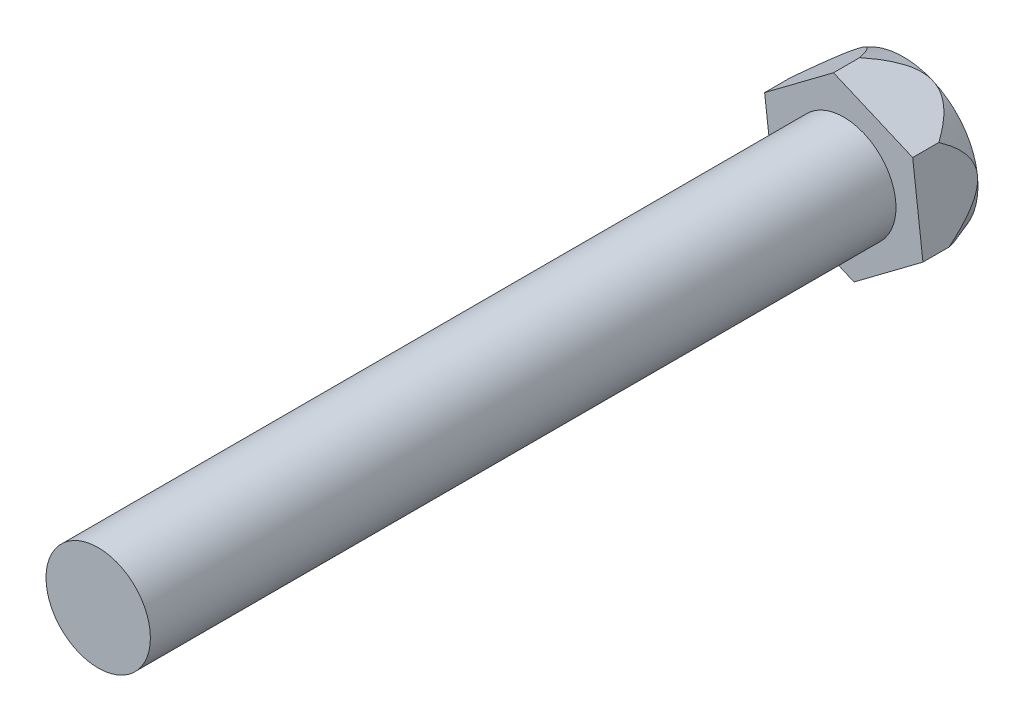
ISO-10303-21;
HEADER;
FILE_DESCRIPTION(('STEP AP214'),'2;1');
FILE_NAME('part.step','',(''),(''),'','','');
FILE_SCHEMA(('AUTOMOTIVE_DESIGN { 1 0 10303 214 1 1 1 1 }'));
ENDSEC;
DATA;
#1=APPLICATION_CONTEXT('core data for automotive mechanical design processes');
#2=APPLICATION_PROTOCOL_DEFINITION('international standard','automotive_design',2000,#1);
#3=PRODUCT_CONTEXT('',#1,'mechanical');
#4=PRODUCT('Part','Part','',(#3));
#5=PRODUCT_RELATED_PRODUCT_CATEGORY('part','',(#4));
#6=PRODUCT_DEFINITION_FORMATION('','',#4);
#7=PRODUCT_DEFINITION_CONTEXT('part definition',#1,'design');
#8=PRODUCT_DEFINITION('design','',#6,#7);
#9=PRODUCT_DEFINITION_SHAPE('','',#8);
#10=(LENGTH_UNIT() NAMED_UNIT(*) SI_UNIT(.MILLI.,.METRE.));
#11=(NAMED_UNIT(*) PLANE_ANGLE_UNIT() SI_UNIT($,.RADIAN.));
#12=(NAMED_UNIT(*) SI_UNIT($,.STERADIAN.) SOLID_ANGLE_UNIT());
#13=UNCERTAINTY_MEASURE_WITH_UNIT(LENGTH_MEASURE(1.E-05),#10,'distance_accuracy_value','');
#14=(GEOMETRIC_REPRESENTATION_CONTEXT(3) GLOBAL_UNCERTAINTY_ASSIGNED_CONTEXT((#13)) GLOBAL_UNIT_ASSIGNED_CONTEXT((#10,
#11,#12)) REPRESENTATION_CONTEXT('',''));
#15=CARTESIAN_POINT('',(0.,0.,0.));
#16=DIRECTION('',(0.,0.,1.));
#17=DIRECTION('',(1.,0.,0.));
#18=AXIS2_PLACEMENT_3D('',#15,#16,#17);
#19=CARTESIAN_POINT('',(-2.65433075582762,1.13483988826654,-2.));
#20=DIRECTION('',(0.599739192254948,-0.800195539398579,0.));
#21=DIRECTION('',(0.800195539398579,0.599739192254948,0.));
#22=AXIS2_PLACEMENT_3D('',#19,#20,#21);
#23=PLANE('',#22);
#24=CARTESIAN_POINT('',(-2.65453075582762,1.13468999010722,-0.876429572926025));
#25=CARTESIAN_POINT('',(-2.61397960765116,1.16508270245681,-0.949895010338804));
#26=CARTESIAN_POINT('',(-2.57240922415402,1.1962393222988,-1.02255898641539));
#27=CARTESIAN_POINT('',(-2.48624521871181,1.26081845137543,-1.16579680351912));
#28=CARTESIAN_POINT('',(-2.44163289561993,1.29425497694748,-1.23635298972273));
#29=CARTESIAN_POINT('',(-2.34691478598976,1.36524532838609,-1.37685450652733));
#30=CARTESIAN_POINT('',(-2.29665431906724,1.40291508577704,-1.44663919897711));
#31=CARTESIAN_POINT('',(-2.19130617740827,1.48187254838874,-1.58002441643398));
#32=CARTESIAN_POINT('',(-2.13623381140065,1.52314877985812,-1.64364328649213));
#33=CARTESIAN_POINT('',(-2.03330510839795,1.60029289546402,-1.74742819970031));
#34=CARTESIAN_POINT('',(-1.98676618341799,1.63517339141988,-1.78960194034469));
#35=CARTESIAN_POINT('',(-1.88962660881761,1.70797860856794,-1.86510191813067));
#36=CARTESIAN_POINT('',(-1.83906018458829,1.74587767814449,-1.89849410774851));
#37=CARTESIAN_POINT('',(-1.7477470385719,1.81431604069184,-1.94555658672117));
#38=CARTESIAN_POINT('',(-1.70796922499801,1.84412914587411,-1.96211055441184));
#39=CARTESIAN_POINT('',(-1.62674464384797,1.90500622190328,-1.98676873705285));
#40=CARTESIAN_POINT('',(-1.58529922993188,1.93606917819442,-1.99487966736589));
#41=CARTESIAN_POINT('',(-1.50171314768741,1.99871617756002,-2.00158308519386));
#42=CARTESIAN_POINT('',(-1.45957020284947,2.03030192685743,-2.00013295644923));
#43=CARTESIAN_POINT('',(-1.37617242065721,2.09280779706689,-1.98782827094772));
#44=CARTESIAN_POINT('',(-1.33491843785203,2.12372727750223,-1.97696504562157));
#45=CARTESIAN_POINT('',(-1.24372484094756,2.19207603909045,-1.94327703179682));
#46=CARTESIAN_POINT('',(-1.19436522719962,2.22907061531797,-1.91805257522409));
#47=CARTESIAN_POINT('',(-1.09940091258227,2.30024549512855,-1.85828360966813));
#48=CARTESIAN_POINT('',(-1.05380691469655,2.33441777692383,-1.82371365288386));
#49=CARTESIAN_POINT('',(-0.968881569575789,2.39806854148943,-1.75047456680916));
#50=CARTESIAN_POINT('',(-0.929338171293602,2.42770595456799,-1.71218048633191));
#51=CARTESIAN_POINT('',(-0.852957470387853,2.48495258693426,-1.63154685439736));
#52=CARTESIAN_POINT('',(-0.816122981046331,2.51255969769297,-1.58920319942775));
#53=CARTESIAN_POINT('',(-0.74465070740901,2.56612750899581,-1.50147563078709));
#54=CARTESIAN_POINT('',(-0.710020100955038,2.59208282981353,-1.4560826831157));
#55=CARTESIAN_POINT('',(-0.642688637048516,2.64254714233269,-1.36310591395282));
#56=CARTESIAN_POINT('',(-0.60998835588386,2.66705570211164,-1.31552144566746));
#57=CARTESIAN_POINT('',(-0.536524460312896,2.72211621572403,-1.20400605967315));
#58=CARTESIAN_POINT('',(-0.496326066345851,2.7522445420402,-1.1394974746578));
#59=CARTESIAN_POINT('',(-0.418538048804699,2.8105459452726,-1.00901477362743));
#60=CARTESIAN_POINT('',(-0.380927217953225,2.83873491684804,-0.943060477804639));
#61=CARTESIAN_POINT('',(-0.344165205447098,2.86628770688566,-0.876429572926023));
#62=B_SPLINE_CURVE_WITH_KNOTS('',3,(#24,#25,#26,#27,#28,#29,#30,#31,#32,#33,#34,#35,#36,#37,#38,
#39,#40,#41,#42,#43,#44,#45,#46,#47,#48,#49,#50,#51,#52,#53,#54,#55,#56,#57,#58,#59,#60,#61),
.UNSPECIFIED.,.F.,.F.,(4,2,2,2,2,2,2,2,2,2,2,2,2,2,2,2,2,2,4),(0.,0.267829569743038,
0.537487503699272,0.818897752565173,1.09944322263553,1.31448609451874,1.52786455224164,
1.68444599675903,1.84090280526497,1.99805745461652,2.15535698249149,2.35415678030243,
2.55350345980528,2.7407772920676,2.92824294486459,3.11629082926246,3.304394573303,
3.54959331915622,3.79245578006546),.UNSPECIFIED.);
#63=CARTESIAN_POINT('',(-2.65433075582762,1.13483988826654,-0.876792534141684));
#64=VERTEX_POINT('',#63);
#65=CARTESIAN_POINT('',(-1.49934798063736,2.00048884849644,-2.));
#66=VERTEX_POINT('',#65);
#67=EDGE_CURVE('E239',#64,#66,#62,.T.);
#68=ORIENTED_EDGE('',*,*,#67,.F.);
#69=DIRECTION('',(0.,0.,1.));
#70=VECTOR('',#69,1.);
#71=CARTESIAN_POINT('',(-2.65433075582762,1.13483988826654,-2.));
#72=LINE('',#71,#70);
#73=CARTESIAN_POINT('',(-2.65433075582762,1.13483988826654,0.));
#74=VERTEX_POINT('',#73);
#75=EDGE_CURVE('E222',#64,#74,#72,.T.);
#76=ORIENTED_EDGE('',*,*,#75,.T.);
#77=DIRECTION('',(0.800195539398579,0.599739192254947,0.));
#78=VECTOR('',#77,1.);
#79=CARTESIAN_POINT('',(-2.65433075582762,1.13483988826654,0.));
#80=LINE('',#79,#78);
#81=CARTESIAN_POINT('',(-0.344365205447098,2.86613780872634,0.));
#82=VERTEX_POINT('',#81);
#83=EDGE_CURVE('E237',#74,#82,#80,.T.);
#84=ORIENTED_EDGE('',*,*,#83,.T.);
#85=DIRECTION('',(0.,0.,1.));
#86=VECTOR('',#85,1.);
#87=CARTESIAN_POINT('',(-0.344365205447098,2.86613780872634,-2.));
#88=LINE('',#87,#86);
#89=CARTESIAN_POINT('',(-0.344365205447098,2.86613780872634,-0.876792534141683));
#90=VERTEX_POINT('',#89);
#91=EDGE_CURVE('E211',#90,#82,#88,.T.);
#92=ORIENTED_EDGE('',*,*,#91,.F.);
#93=EDGE_CURVE('E107',#66,#90,#62,.T.);
#94=ORIENTED_EDGE('',*,*,#93,.F.);
#95=EDGE_LOOP('',(#68,#76,#84,#92,#94));
#96=FACE_BOUND('',#95,.T.);
#97=ADVANCED_FACE('F31',(#96),#23,.F.);
#98=CARTESIAN_POINT('',(-0.344365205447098,2.86613780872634,-2.));
#99=DIRECTION('',(-0.393120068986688,-0.919487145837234,0.));
#100=DIRECTION('',(0.919487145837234,-0.393120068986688,0.));
#101=AXIS2_PLACEMENT_3D('',#98,#99,#100);
#102=PLANE('',#101);
#103=CARTESIAN_POINT('',(-0.344565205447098,2.86622331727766,-0.876476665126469));
#104=CARTESIAN_POINT('',(-0.297968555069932,2.84630125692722,-0.949941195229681));
#105=CARTESIAN_POINT('',(-0.250200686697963,2.82587845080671,-1.02260423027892));
#106=CARTESIAN_POINT('',(-0.151190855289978,2.78354751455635,-1.16584008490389));
#107=CARTESIAN_POINT('',(-0.0999273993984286,2.76163019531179,-1.23639524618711));
#108=CARTESIAN_POINT('',(0.00891229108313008,2.71509657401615,-1.37689467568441));
#109=CARTESIAN_POINT('',(0.066666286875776,2.69040427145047,-1.4466782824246));
#110=CARTESIAN_POINT('',(0.187721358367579,2.63864805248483,-1.58006082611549));
#111=CARTESIAN_POINT('',(0.251004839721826,2.61159165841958,-1.6436781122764));
#112=CARTESIAN_POINT('',(0.369278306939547,2.56102469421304,-1.74745794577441));
#113=CARTESIAN_POINT('',(0.422754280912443,2.53816142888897,-1.78962856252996));
#114=CARTESIAN_POINT('',(0.534373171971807,2.49043958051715,-1.8651221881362));
#115=CARTESIAN_POINT('',(0.592476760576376,2.46559781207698,-1.89851115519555));
#116=CARTESIAN_POINT('',(0.697401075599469,2.42073818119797,-1.94556857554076));
#117=CARTESIAN_POINT('',(0.743108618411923,2.40119625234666,-1.96212053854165));
#118=CARTESIAN_POINT('',(0.836441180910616,2.36129259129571,-1.98677468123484));
#119=CARTESIAN_POINT('',(0.884064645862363,2.34093152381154,-1.9948835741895));
#120=CARTESIAN_POINT('',(0.980110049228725,2.29986800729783,-2.00158313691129));
#121=CARTESIAN_POINT('',(1.02853460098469,2.27916444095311,-2.00013120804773));
#122=CARTESIAN_POINT('',(1.1243629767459,2.23819371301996,-1.98782344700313));
#123=CARTESIAN_POINT('',(1.17176581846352,2.21792697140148,-1.97695894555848));
#124=CARTESIAN_POINT('',(1.27655467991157,2.17312525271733,-1.94326771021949));
#125=CARTESIAN_POINT('',(1.33327403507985,2.14887530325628,-1.91804080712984));
#126=CARTESIAN_POINT('',(1.44239774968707,2.10222024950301,-1.85826685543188));
#127=CARTESIAN_POINT('',(1.49478980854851,2.0798204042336,-1.82369435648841));
#128=CARTESIAN_POINT('',(1.59237886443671,2.03809691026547,-1.75044929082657));
#129=CARTESIAN_POINT('',(1.63781942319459,2.01866912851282,-1.71215159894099));
#130=CARTESIAN_POINT('',(1.72559076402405,1.98114312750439,-1.63151059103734));
#131=CARTESIAN_POINT('',(1.76791831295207,1.96304629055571,-1.58916317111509));
#132=CARTESIAN_POINT('',(1.85004901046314,1.9279319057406,-1.50142802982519));
#133=CARTESIAN_POINT('',(1.88984391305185,1.91091788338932,-1.45603127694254));
#134=CARTESIAN_POINT('',(1.9672161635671,1.87783793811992,-1.36304687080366));
#135=CARTESIAN_POINT('',(2.00479284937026,1.86177229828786,-1.31545857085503));
#136=CARTESIAN_POINT('',(2.08919479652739,1.82568685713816,-1.20395701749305));
#137=CARTESIAN_POINT('',(2.13537167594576,1.80594426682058,-1.13946709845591));
#138=CARTESIAN_POINT('',(2.22472961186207,1.76773992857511,-1.00902258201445));
#139=CARTESIAN_POINT('',(2.26793501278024,1.74926777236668,-0.94308778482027));
#140=CARTESIAN_POINT('',(2.31016555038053,1.73121241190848,-0.876476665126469));
#141=B_SPLINE_CURVE_WITH_KNOTS('',3,(#103,#104,#105,#106,#107,#108,#109,#110,#111,#112,#113,
#114,#115,#116,#117,#118,#119,#120,#121,#122,#123,#124,#125,#126,#127,#128,#129,#130,#131,#132,
#133,#134,#135,#136,#137,#138,#139,#140),.UNSPECIFIED.,.F.,.F.,(4,2,2,2,2,2,2,2,2,2,2,2,2,2,2,2,
2,2,4),(0.,0.26782773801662,0.537484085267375,0.818893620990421,1.09943825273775,
1.31447326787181,1.5278438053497,1.6844224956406,1.84087659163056,1.99802824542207,
2.15532479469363,2.35413126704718,2.55348468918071,2.74077056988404,2.92824829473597,
3.11630811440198,3.30442378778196,3.54954994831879,3.79234144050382),.UNSPECIFIED.);
#142=CARTESIAN_POINT('',(0.982800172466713,2.29871786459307,-2.));
#143=VERTEX_POINT('',#142);
#144=EDGE_CURVE('E103',#90,#143,#141,.T.);
#145=ORIENTED_EDGE('',*,*,#144,.F.);
#146=ORIENTED_EDGE('',*,*,#91,.T.);
#147=DIRECTION('',(0.919487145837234,-0.393120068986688,0.));
#148=VECTOR('',#147,1.);
#149=CARTESIAN_POINT('',(-0.344365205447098,2.86613780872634,0.));
#150=LINE('',#149,#148);
#151=CARTESIAN_POINT('',(2.30996555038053,1.7312979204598,0.));
#152=VERTEX_POINT('',#151);
#153=EDGE_CURVE('E236',#82,#152,#150,.T.);
#154=ORIENTED_EDGE('',*,*,#153,.T.);
#155=DIRECTION('',(0.,0.,1.));
#156=VECTOR('',#155,1.);
#157=CARTESIAN_POINT('',(2.30996555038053,1.7312979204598,-2.));
#158=LINE('',#157,#156);
#159=CARTESIAN_POINT('',(2.30996555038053,1.7312979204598,-0.876792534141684));
#160=VERTEX_POINT('',#159);
#161=EDGE_CURVE('E126',#160,#152,#158,.T.);
#162=ORIENTED_EDGE('',*,*,#161,.F.);
#163=EDGE_CURVE('E111',#143,#160,#141,.T.);
#164=ORIENTED_EDGE('',*,*,#163,.F.);
#165=EDGE_LOOP('',(#145,#146,#154,#162,#164));
#166=FACE_BOUND('',#165,.T.);
#167=ADVANCED_FACE('F124',(#166),#102,.F.);
#168=CARTESIAN_POINT('',(2.30996555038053,1.7312979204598,-2.));
#169=DIRECTION('',(-0.992859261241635,-0.119291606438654,0.));
#170=DIRECTION('',(0.119291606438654,-0.992859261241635,0.));
#171=AXIS2_PLACEMENT_3D('',#168,#169,#170);
#172=PLANE('',#171);
#173=CARTESIAN_POINT('',(2.30994152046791,1.7314979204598,-0.876500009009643));
#174=CARTESIAN_POINT('',(2.31598684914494,1.68118289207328,-0.949964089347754));
#175=CARTESIAN_POINT('',(2.32218413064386,1.62960316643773,-1.02262665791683));
#176=CARTESIAN_POINT('',(2.33502942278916,1.5226923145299,-1.16586153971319));
#177=CARTESIAN_POINT('',(2.34168022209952,1.46733797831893,-1.23641619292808));
#178=CARTESIAN_POINT('',(2.35580084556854,1.34981259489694,-1.3769145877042));
#179=CARTESIAN_POINT('',(2.36329373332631,1.28744959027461,-1.44669765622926));
#180=CARTESIAN_POINT('',(2.37899918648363,1.15673373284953,-1.58007887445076));
#181=CARTESIAN_POINT('',(2.3872094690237,1.08839988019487,-1.64369537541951));
#182=CARTESIAN_POINT('',(2.40255394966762,0.960688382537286,-1.74747269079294));
#183=CARTESIAN_POINT('',(2.40949171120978,0.902945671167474,-1.78964175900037));
#184=CARTESIAN_POINT('',(2.42397269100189,0.78242105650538,-1.86513223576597));
#185=CARTESIAN_POINT('',(2.43151080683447,0.719681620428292,-1.89851960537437));
#186=CARTESIAN_POINT('',(2.44512328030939,0.606385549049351,-1.94557451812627));
#187=CARTESIAN_POINT('',(2.45105322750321,0.557030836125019,-1.96212548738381));
#188=CARTESIAN_POINT('',(2.46316187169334,0.456251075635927,-1.98677762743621));
#189=CARTESIAN_POINT('',(2.46934036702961,0.404827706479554,-1.99488551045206));
#190=CARTESIAN_POINT('',(2.48180092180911,0.301119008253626,-2.00158316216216));
#191=CARTESIAN_POINT('',(2.48808332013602,0.248830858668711,-2.00013034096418));
#192=CARTESIAN_POINT('',(2.50051567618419,0.145356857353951,-1.9878210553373));
#193=CARTESIAN_POINT('',(2.50666550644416,0.094172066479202,-1.97695592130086));
#194=CARTESIAN_POINT('',(2.52026052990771,-0.0189787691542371,-1.94326308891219));
#195=CARTESIAN_POINT('',(2.5276192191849,-0.0802248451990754,-1.91803497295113));
#196=CARTESIAN_POINT('',(2.54177676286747,-0.198057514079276,-1.85825854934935));
#197=CARTESIAN_POINT('',(2.54857402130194,-0.254630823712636,-1.82368479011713));
#198=CARTESIAN_POINT('',(2.56123514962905,-0.360008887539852,-1.75043675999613));
#199=CARTESIAN_POINT('',(2.56713061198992,-0.40907658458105,-1.71213727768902));
#200=CARTESIAN_POINT('',(2.57851806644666,-0.503853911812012,-1.63149261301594));
#201=CARTESIAN_POINT('',(2.58400963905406,-0.54956005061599,-1.58914332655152));
#202=CARTESIAN_POINT('',(2.59466526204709,-0.638246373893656,-1.50140443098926));
#203=CARTESIAN_POINT('',(2.59982824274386,-0.681217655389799,-1.45600579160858));
#204=CARTESIAN_POINT('',(2.60986649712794,-0.764765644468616,-1.36301759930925));
#205=CARTESIAN_POINT('',(2.61474168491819,-0.80534163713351,-1.31542739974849));
#206=CARTESIAN_POINT('',(2.62569086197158,-0.896471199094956,-1.20393270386));
#207=CARTESIAN_POINT('',(2.63168080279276,-0.946325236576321,-1.13945203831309));
#208=CARTESIAN_POINT('',(2.64327213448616,-1.04279942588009,-1.00902645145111));
#209=CARTESIAN_POINT('',(2.64887668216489,-1.08944585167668,-0.943101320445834));
#210=CARTESIAN_POINT('',(2.65435478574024,-1.13503988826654,-0.876500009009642));
#211=B_SPLINE_CURVE_WITH_KNOTS('',3,(#173,#174,#175,#176,#177,#178,#179,#180,#181,#182,#183,
#184,#185,#186,#187,#188,#189,#190,#191,#192,#193,#194,#195,#196,#197,#198,#199,#200,#201,#202,
#203,#204,#205,#206,#207,#208,#209,#210),.UNSPECIFIED.,.F.,.F.,(4,2,2,2,2,2,2,2,2,2,2,2,2,2,2,2,
2,2,4),(0.,0.267826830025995,0.537482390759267,0.818891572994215,1.0994357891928,
1.31446690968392,1.5278335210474,1.68441084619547,1.84086359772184,1.99801376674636,
2.15530883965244,2.35411862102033,2.55347538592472,2.74076723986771,2.92825094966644,
3.11631668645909,3.30443827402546,3.54952845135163,3.79228476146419),.UNSPECIFIED.);
#212=CARTESIAN_POINT('',(2.48214815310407,0.298229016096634,-2.));
#213=VERTEX_POINT('',#212);
#214=EDGE_CURVE('E116',#160,#213,#211,.T.);
#215=ORIENTED_EDGE('',*,*,#214,.F.);
#216=ORIENTED_EDGE('',*,*,#161,.T.);
#217=DIRECTION('',(0.119291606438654,-0.992859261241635,0.));
#218=VECTOR('',#217,1.);
#219=CARTESIAN_POINT('',(2.30996555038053,1.7312979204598,0.));
#220=LINE('',#219,#218);
#221=CARTESIAN_POINT('',(2.65433075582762,-1.13483988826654,0.));
#222=VERTEX_POINT('',#221);
#223=EDGE_CURVE('E233',#152,#222,#220,.T.);
#224=ORIENTED_EDGE('',*,*,#223,.T.);
#225=DIRECTION('',(0.,0.,1.));
#226=VECTOR('',#225,1.);
#227=CARTESIAN_POINT('',(2.65433075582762,-1.13483988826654,-2.));
#228=LINE('',#227,#226);
#229=CARTESIAN_POINT('',(2.65433075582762,-1.13483988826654,-0.876792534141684));
#230=VERTEX_POINT('',#229);
#231=EDGE_CURVE('E216',#230,#222,#228,.T.);
#232=ORIENTED_EDGE('',*,*,#231,.F.);
#233=EDGE_CURVE('E127',#213,#230,#211,.T.);
#234=ORIENTED_EDGE('',*,*,#233,.F.);
#235=EDGE_LOOP('',(#215,#216,#224,#232,#234));
#236=FACE_BOUND('',#235,.T.);
#237=ADVANCED_FACE('F181',(#236),#172,.F.);
#238=CARTESIAN_POINT('',(2.65433075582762,-1.13483988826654,-2.));
#239=DIRECTION('',(-0.599739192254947,0.800195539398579,0.));
#240=DIRECTION('',(-0.800195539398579,-0.599739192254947,0.));
#241=AXIS2_PLACEMENT_3D('',#238,#239,#240);
#242=PLANE('',#241);
#243=CARTESIAN_POINT('',(2.65453075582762,-1.13468999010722,-0.876429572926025));
#244=CARTESIAN_POINT('',(2.61397960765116,-1.16508270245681,-0.949895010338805));
#245=CARTESIAN_POINT('',(2.57240922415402,-1.1962393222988,-1.02255898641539));
#246=CARTESIAN_POINT('',(2.48624521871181,-1.26081845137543,-1.16579680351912));
#247=CARTESIAN_POINT('',(2.44163289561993,-1.29425497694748,-1.23635298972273));
#248=CARTESIAN_POINT('',(2.34691478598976,-1.36524532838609,-1.37685450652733));
#249=CARTESIAN_POINT('',(2.29665431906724,-1.40291508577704,-1.44663919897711));
#250=CARTESIAN_POINT('',(2.19130617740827,-1.48187254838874,-1.58002441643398));
#251=CARTESIAN_POINT('',(2.13623381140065,-1.52314877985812,-1.64364328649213));
#252=CARTESIAN_POINT('',(2.03330510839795,-1.60029289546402,-1.74742819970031));
#253=CARTESIAN_POINT('',(1.986766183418,-1.63517339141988,-1.78960194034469));
#254=CARTESIAN_POINT('',(1.88962660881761,-1.70797860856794,-1.86510191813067));
#255=CARTESIAN_POINT('',(1.83906018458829,-1.74587767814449,-1.89849410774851));
#256=CARTESIAN_POINT('',(1.7477470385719,-1.81431604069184,-1.94555658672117));
#257=CARTESIAN_POINT('',(1.70796922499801,-1.84412914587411,-1.96211055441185));
#258=CARTESIAN_POINT('',(1.62674464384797,-1.90500622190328,-1.98676873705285));
#259=CARTESIAN_POINT('',(1.58529922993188,-1.93606917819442,-1.99487966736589));
#260=CARTESIAN_POINT('',(1.50171314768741,-1.99871617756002,-2.00158308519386));
#261=CARTESIAN_POINT('',(1.45957020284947,-2.03030192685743,-2.00013295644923));
#262=CARTESIAN_POINT('',(1.37617242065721,-2.09280779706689,-1.98782827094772));
#263=CARTESIAN_POINT('',(1.33491843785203,-2.12372727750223,-1.97696504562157));
#264=CARTESIAN_POINT('',(1.24372484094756,-2.19207603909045,-1.94327703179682));
#265=CARTESIAN_POINT('',(1.19436522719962,-2.22907061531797,-1.91805257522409));
#266=CARTESIAN_POINT('',(1.09940091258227,-2.30024549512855,-1.85828360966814));
#267=CARTESIAN_POINT('',(1.05380691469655,-2.33441777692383,-1.82371365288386));
#268=CARTESIAN_POINT('',(0.968881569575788,-2.39806854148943,-1.75047456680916));
#269=CARTESIAN_POINT('',(0.929338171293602,-2.42770595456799,-1.71218048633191));
#270=CARTESIAN_POINT('',(0.852957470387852,-2.48495258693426,-1.63154685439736));
#271=CARTESIAN_POINT('',(0.81612298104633,-2.51255969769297,-1.58920319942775));
#272=CARTESIAN_POINT('',(0.744650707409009,-2.56612750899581,-1.50147563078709));
#273=CARTESIAN_POINT('',(0.710020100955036,-2.59208282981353,-1.4560826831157));
#274=CARTESIAN_POINT('',(0.642688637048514,-2.64254714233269,-1.36310591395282));
#275=CARTESIAN_POINT('',(0.609988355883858,-2.66705570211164,-1.31552144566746));
#276=CARTESIAN_POINT('',(0.536524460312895,-2.72211621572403,-1.20400605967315));
#277=CARTESIAN_POINT('',(0.49632606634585,-2.7522445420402,-1.1394974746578));
#278=CARTESIAN_POINT('',(0.418538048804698,-2.8105459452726,-1.00901477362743));
#279=CARTESIAN_POINT('',(0.380927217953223,-2.83873491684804,-0.94306047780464));
#280=CARTESIAN_POINT('',(0.344165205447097,-2.86628770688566,-0.876429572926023));
#281=B_SPLINE_CURVE_WITH_KNOTS('',3,(#243,#244,#245,#246,#247,#248,#249,#250,#251,#252,#253,
#254,#255,#256,#257,#258,#259,#260,#261,#262,#263,#264,#265,#266,#267,#268,#269,#270,#271,#272,
#273,#274,#275,#276,#277,#278,#279,#280),.UNSPECIFIED.,.F.,.F.,(4,2,2,2,2,2,2,2,2,2,2,2,2,2,2,2,
2,2,4),(0.,0.267829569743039,0.537487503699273,0.818897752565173,1.09944322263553,
1.31448609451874,1.52786455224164,1.68444599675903,1.84090280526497,1.99805745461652,
2.15535698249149,2.35415678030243,2.55350345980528,2.7407772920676,2.92824294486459,
3.11629082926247,3.304394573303,3.54959331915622,3.79245578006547),.UNSPECIFIED.);
#282=CARTESIAN_POINT('',(1.49934798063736,-2.00048884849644,-2.));
#283=VERTEX_POINT('',#282);
#284=EDGE_CURVE('E175',#230,#283,#281,.T.);
#285=ORIENTED_EDGE('',*,*,#284,.F.);
#286=ORIENTED_EDGE('',*,*,#231,.T.);
#287=DIRECTION('',(-0.800195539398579,-0.599739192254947,0.));
#288=VECTOR('',#287,1.);
#289=CARTESIAN_POINT('',(2.65433075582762,-1.13483988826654,0.));
#290=LINE('',#289,#288);
#291=CARTESIAN_POINT('',(0.344365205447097,-2.86613780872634,0.));
#292=VERTEX_POINT('',#291);
#293=EDGE_CURVE('E230',#222,#292,#290,.T.);
#294=ORIENTED_EDGE('',*,*,#293,.T.);
#295=DIRECTION('',(0.,0.,1.));
#296=VECTOR('',#295,1.);
#297=CARTESIAN_POINT('',(0.344365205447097,-2.86613780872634,-2.));
#298=LINE('',#297,#296);
#299=CARTESIAN_POINT('',(0.344365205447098,-2.86613780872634,-0.876792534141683));
#300=VERTEX_POINT('',#299);
#301=EDGE_CURVE('E218',#300,#292,#298,.T.);
#302=ORIENTED_EDGE('',*,*,#301,.F.);
#303=EDGE_CURVE('E170',#283,#300,#281,.T.);
#304=ORIENTED_EDGE('',*,*,#303,.F.);
#305=EDGE_LOOP('',(#285,#286,#294,#302,#304));
#306=FACE_BOUND('',#305,.T.);
#307=ADVANCED_FACE('F177',(#306),#242,.F.);
#308=CARTESIAN_POINT('',(0.344365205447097,-2.86613780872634,-2.));
#309=DIRECTION('',(0.393120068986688,0.919487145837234,0.));
#310=DIRECTION('',(-0.919487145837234,0.393120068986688,0.));
#311=AXIS2_PLACEMENT_3D('',#308,#309,#310);
#312=PLANE('',#311);
#313=CARTESIAN_POINT('',(0.344565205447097,-2.86622331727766,-0.876476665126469));
#314=CARTESIAN_POINT('',(0.297968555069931,-2.84630125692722,-0.949941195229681));
#315=CARTESIAN_POINT('',(0.250200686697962,-2.82587845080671,-1.02260423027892));
#316=CARTESIAN_POINT('',(0.151190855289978,-2.78354751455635,-1.16584008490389));
#317=CARTESIAN_POINT('',(0.0999273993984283,-2.76163019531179,-1.23639524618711));
#318=CARTESIAN_POINT('',(-0.00891229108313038,-2.71509657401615,-1.37689467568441));
#319=CARTESIAN_POINT('',(-0.0666662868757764,-2.69040427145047,-1.4466782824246));
#320=CARTESIAN_POINT('',(-0.187721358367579,-2.63864805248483,-1.58006082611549));
#321=CARTESIAN_POINT('',(-0.251004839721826,-2.61159165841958,-1.6436781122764));
#322=CARTESIAN_POINT('',(-0.369278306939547,-2.56102469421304,-1.74745794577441));
#323=CARTESIAN_POINT('',(-0.422754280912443,-2.53816142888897,-1.78962856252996));
#324=CARTESIAN_POINT('',(-0.534373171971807,-2.49043958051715,-1.8651221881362));
#325=CARTESIAN_POINT('',(-0.592476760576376,-2.46559781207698,-1.89851115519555));
#326=CARTESIAN_POINT('',(-0.697401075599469,-2.42073818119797,-1.94556857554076));
#327=CARTESIAN_POINT('',(-0.743108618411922,-2.40119625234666,-1.96212053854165));
#328=CARTESIAN_POINT('',(-0.836441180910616,-2.36129259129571,-1.98677468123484));
#329=CARTESIAN_POINT('',(-0.884064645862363,-2.34093152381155,-1.9948835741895));
#330=CARTESIAN_POINT('',(-0.980110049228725,-2.29986800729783,-2.00158313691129));
#331=CARTESIAN_POINT('',(-1.02853460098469,-2.27916444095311,-2.00013120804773));
#332=CARTESIAN_POINT('',(-1.1243629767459,-2.23819371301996,-1.98782344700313));
#333=CARTESIAN_POINT('',(-1.17176581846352,-2.21792697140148,-1.97695894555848));
#334=CARTESIAN_POINT('',(-1.27655467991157,-2.17312525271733,-1.9432677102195));
#335=CARTESIAN_POINT('',(-1.33327403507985,-2.14887530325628,-1.91804080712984));
#336=CARTESIAN_POINT('',(-1.44239774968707,-2.10222024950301,-1.85826685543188));
#337=CARTESIAN_POINT('',(-1.49478980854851,-2.0798204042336,-1.82369435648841));
#338=CARTESIAN_POINT('',(-1.59237886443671,-2.03809691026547,-1.75044929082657));
#339=CARTESIAN_POINT('',(-1.63781942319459,-2.01866912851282,-1.71215159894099));
#340=CARTESIAN_POINT('',(-1.72559076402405,-1.98114312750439,-1.63151059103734));
#341=CARTESIAN_POINT('',(-1.76791831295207,-1.96304629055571,-1.58916317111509));
#342=CARTESIAN_POINT('',(-1.85004901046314,-1.9279319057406,-1.50142802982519));
#343=CARTESIAN_POINT('',(-1.88984391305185,-1.91091788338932,-1.45603127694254));
#344=CARTESIAN_POINT('',(-1.9672161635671,-1.87783793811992,-1.36304687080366));
#345=CARTESIAN_POINT('',(-2.00479284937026,-1.86177229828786,-1.31545857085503));
#346=CARTESIAN_POINT('',(-2.08919479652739,-1.82568685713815,-1.20395701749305));
#347=CARTESIAN_POINT('',(-2.13537167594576,-1.80594426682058,-1.13946709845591));
#348=CARTESIAN_POINT('',(-2.22472961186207,-1.76773992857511,-1.00902258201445));
#349=CARTESIAN_POINT('',(-2.26793501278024,-1.74926777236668,-0.943087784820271));
#350=CARTESIAN_POINT('',(-2.31016555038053,-1.73121241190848,-0.876476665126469));
#351=B_SPLINE_CURVE_WITH_KNOTS('',3,(#313,#314,#315,#316,#317,#318,#319,#320,#321,#322,#323,
#324,#325,#326,#327,#328,#329,#330,#331,#332,#333,#334,#335,#336,#337,#338,#339,#340,#341,#342,
#343,#344,#345,#346,#347,#348,#349,#350),.UNSPECIFIED.,.F.,.F.,(4,2,2,2,2,2,2,2,2,2,2,2,2,2,2,2,
2,2,4),(0.,0.26782773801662,0.537484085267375,0.818893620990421,1.09943825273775,
1.31447326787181,1.5278438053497,1.6844224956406,1.84087659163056,1.99802824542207,
2.15532479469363,2.35413126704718,2.55348468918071,2.74077056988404,2.92824829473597,
3.11630811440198,3.30442378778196,3.54954994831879,3.79234144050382),.UNSPECIFIED.);
#352=CARTESIAN_POINT('',(-0.982800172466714,-2.29871786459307,-2.));
#353=VERTEX_POINT('',#352);
#354=EDGE_CURVE('E176',#300,#353,#351,.T.);
#355=ORIENTED_EDGE('',*,*,#354,.F.);
#356=ORIENTED_EDGE('',*,*,#301,.T.);
#357=DIRECTION('',(-0.919487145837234,0.393120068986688,0.));
#358=VECTOR('',#357,1.);
#359=CARTESIAN_POINT('',(0.344365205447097,-2.86613780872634,0.));
#360=LINE('',#359,#358);
#361=CARTESIAN_POINT('',(-2.30996555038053,-1.7312979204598,0.));
#362=VERTEX_POINT('',#361);
#363=EDGE_CURVE('E227',#292,#362,#360,.T.);
#364=ORIENTED_EDGE('',*,*,#363,.T.);
#365=DIRECTION('',(0.,0.,1.));
#366=VECTOR('',#365,1.);
#367=CARTESIAN_POINT('',(-2.30996555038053,-1.7312979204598,-2.));
#368=LINE('',#367,#366);
#369=CARTESIAN_POINT('',(-2.30996555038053,-1.7312979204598,-0.876792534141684));
#370=VERTEX_POINT('',#369);
#371=EDGE_CURVE('E220',#370,#362,#368,.T.);
#372=ORIENTED_EDGE('',*,*,#371,.F.);
#373=EDGE_CURVE('E164',#353,#370,#351,.T.);
#374=ORIENTED_EDGE('',*,*,#373,.F.);
#375=EDGE_LOOP('',(#355,#356,#364,#372,#374));
#376=FACE_BOUND('',#375,.T.);
#377=ADVANCED_FACE('F180',(#376),#312,.F.);
#378=CARTESIAN_POINT('',(-2.30996555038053,-1.7312979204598,-2.));
#379=DIRECTION('',(0.992859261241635,0.119291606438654,0.));
#380=DIRECTION('',(-0.119291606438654,0.992859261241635,0.));
#381=AXIS2_PLACEMENT_3D('',#378,#379,#380);
#382=PLANE('',#381);
#383=CARTESIAN_POINT('',(-2.30994152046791,-1.7314979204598,-0.876500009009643));
#384=CARTESIAN_POINT('',(-2.31598684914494,-1.68118289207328,-0.949964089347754));
#385=CARTESIAN_POINT('',(-2.32218413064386,-1.62960316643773,-1.02262665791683));
#386=CARTESIAN_POINT('',(-2.33502942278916,-1.5226923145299,-1.16586153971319));
#387=CARTESIAN_POINT('',(-2.34168022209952,-1.46733797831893,-1.23641619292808));
#388=CARTESIAN_POINT('',(-2.35580084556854,-1.34981259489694,-1.3769145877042));
#389=CARTESIAN_POINT('',(-2.36329373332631,-1.28744959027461,-1.44669765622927));
#390=CARTESIAN_POINT('',(-2.37899918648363,-1.15673373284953,-1.58007887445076));
#391=CARTESIAN_POINT('',(-2.3872094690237,-1.08839988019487,-1.64369537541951));
#392=CARTESIAN_POINT('',(-2.40255394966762,-0.960688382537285,-1.74747269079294));
#393=CARTESIAN_POINT('',(-2.40949171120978,-0.902945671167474,-1.78964175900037));
#394=CARTESIAN_POINT('',(-2.42397269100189,-0.78242105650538,-1.86513223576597));
#395=CARTESIAN_POINT('',(-2.43151080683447,-0.719681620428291,-1.89851960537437));
#396=CARTESIAN_POINT('',(-2.44512328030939,-0.60638554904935,-1.94557451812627));
#397=CARTESIAN_POINT('',(-2.45105322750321,-0.557030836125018,-1.96212548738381));
#398=CARTESIAN_POINT('',(-2.46316187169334,-0.456251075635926,-1.98677762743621));
#399=CARTESIAN_POINT('',(-2.46934036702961,-0.404827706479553,-1.99488551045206));
#400=CARTESIAN_POINT('',(-2.48180092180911,-0.301119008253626,-2.00158316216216));
#401=CARTESIAN_POINT('',(-2.48808332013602,-0.24883085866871,-2.00013034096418));
#402=CARTESIAN_POINT('',(-2.50051567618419,-0.14535685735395,-1.9878210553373));
#403=CARTESIAN_POINT('',(-2.50666550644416,-0.0941720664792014,-1.97695592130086));
#404=CARTESIAN_POINT('',(-2.52026052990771,0.0189787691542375,-1.94326308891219));
#405=CARTESIAN_POINT('',(-2.5276192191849,0.0802248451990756,-1.91803497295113));
#406=CARTESIAN_POINT('',(-2.54177676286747,0.198057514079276,-1.85825854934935));
#407=CARTESIAN_POINT('',(-2.54857402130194,0.254630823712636,-1.82368479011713));
#408=CARTESIAN_POINT('',(-2.56123514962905,0.360008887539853,-1.75043675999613));
#409=CARTESIAN_POINT('',(-2.56713061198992,0.409076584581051,-1.71213727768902));
#410=CARTESIAN_POINT('',(-2.57851806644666,0.503853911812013,-1.63149261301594));
#411=CARTESIAN_POINT('',(-2.58400963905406,0.549560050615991,-1.58914332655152));
#412=CARTESIAN_POINT('',(-2.59466526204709,0.638246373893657,-1.50140443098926));
#413=CARTESIAN_POINT('',(-2.59982824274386,0.6812176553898,-1.45600579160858));
#414=CARTESIAN_POINT('',(-2.60986649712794,0.764765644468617,-1.36301759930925));
#415=CARTESIAN_POINT('',(-2.61474168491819,0.805341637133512,-1.31542739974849));
#416=CARTESIAN_POINT('',(-2.62569086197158,0.896471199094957,-1.20393270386));
#417=CARTESIAN_POINT('',(-2.63168080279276,0.946325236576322,-1.13945203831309));
#418=CARTESIAN_POINT('',(-2.64327213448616,1.04279942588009,-1.0090264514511));
#419=CARTESIAN_POINT('',(-2.64887668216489,1.08944585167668,-0.943101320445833));
#420=CARTESIAN_POINT('',(-2.65435478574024,1.13503988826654,-0.876500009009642));
#421=B_SPLINE_CURVE_WITH_KNOTS('',3,(#383,#384,#385,#386,#387,#388,#389,#390,#391,#392,#393,
#394,#395,#396,#397,#398,#399,#400,#401,#402,#403,#404,#405,#406,#407,#408,#409,#410,#411,#412,
#413,#414,#415,#416,#417,#418,#419,#420),.UNSPECIFIED.,.F.,.F.,(4,2,2,2,2,2,2,2,2,2,2,2,2,2,2,2,
2,2,4),(0.,0.267826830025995,0.537482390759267,0.818891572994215,1.0994357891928,
1.31446690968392,1.5278335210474,1.68441084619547,1.84086359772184,1.99801376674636,
2.15530883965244,2.35411862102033,2.55347538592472,2.74076723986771,2.92825094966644,
3.11631668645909,3.30443827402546,3.54952845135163,3.79228476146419),.UNSPECIFIED.);
#422=CARTESIAN_POINT('',(-2.48214815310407,-0.298229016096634,-2.));
#423=VERTEX_POINT('',#422);
#424=EDGE_CURVE('E266',#370,#423,#421,.T.);
#425=ORIENTED_EDGE('',*,*,#424,.F.);
#426=ORIENTED_EDGE('',*,*,#371,.T.);
#427=DIRECTION('',(-0.119291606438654,0.992859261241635,0.));
#428=VECTOR('',#427,1.);
#429=CARTESIAN_POINT('',(-2.30996555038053,-1.7312979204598,0.));
#430=LINE('',#429,#428);
#431=EDGE_CURVE('E224',#362,#74,#430,.T.);
#432=ORIENTED_EDGE('',*,*,#431,.T.);
#433=ORIENTED_EDGE('',*,*,#75,.F.);
#434=EDGE_CURVE('E121',#423,#64,#421,.T.);
#435=ORIENTED_EDGE('',*,*,#434,.F.);
#436=EDGE_LOOP('',(#425,#426,#432,#433,#435));
#437=FACE_BOUND('',#436,.T.);
#438=ADVANCED_FACE('F204',(#437),#382,.F.);
#439=CARTESIAN_POINT('',(0.,0.,25.));
#440=DIRECTION('',(0.,0.,-1.));
#441=DIRECTION('',(-1.,0.,0.));
#442=AXIS2_PLACEMENT_3D('',#439,#440,#441);
#443=CYLINDRICAL_SURFACE('',#442,1.75);
#444=CARTESIAN_POINT('',(0.,0.,25.));
#445=DIRECTION('',(0.,0.,1.));
#446=DIRECTION('',(1.,0.,0.));
#447=AXIS2_PLACEMENT_3D('',#444,#445,#446);
#448=CIRCLE('',#447,1.75);
#449=CARTESIAN_POINT('',(1.75,0.,25.));
#450=VERTEX_POINT('',#449);
#451=EDGE_CURVE('E208',#450,#450,#448,.T.);
#452=ORIENTED_EDGE('',*,*,#451,.F.);
#453=EDGE_LOOP('',(#452));
#454=FACE_BOUND('',#453,.T.);
#455=CARTESIAN_POINT('',(0.,0.,0.));
#456=DIRECTION('',(0.,0.,-1.));
#457=DIRECTION('',(-1.,0.,0.));
#458=AXIS2_PLACEMENT_3D('',#455,#456,#457);
#459=CIRCLE('',#458,1.75);
#460=CARTESIAN_POINT('',(-1.75,0.,0.));
#461=VERTEX_POINT('',#460);
#462=EDGE_CURVE('E209',#461,#461,#459,.T.);
#463=ORIENTED_EDGE('',*,*,#462,.F.);
#464=EDGE_LOOP('',(#463));
#465=FACE_BOUND('',#464,.T.);
#466=ADVANCED_FACE('F33',(#454,#465),#443,.T.);
#467=CARTESIAN_POINT('',(0.,0.,25.));
#468=DIRECTION('',(0.,0.,1.));
#469=DIRECTION('',(1.,0.,0.));
#470=AXIS2_PLACEMENT_3D('',#467,#468,#469);
#471=PLANE('',#470);
#472=ORIENTED_EDGE('',*,*,#451,.T.);
#473=EDGE_LOOP('',(#472));
#474=FACE_BOUND('',#473,.T.);
#475=ADVANCED_FACE('F196',(#474),#471,.T.);
#476=CARTESIAN_POINT('',(-0.344365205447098,2.86613780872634,0.));
#477=DIRECTION('',(0.,0.,-1.));
#478=DIRECTION('',(-1.,0.,0.));
#479=AXIS2_PLACEMENT_3D('',#476,#477,#478);
#480=PLANE('',#479);
#481=ORIENTED_EDGE('',*,*,#83,.F.);
#482=ORIENTED_EDGE('',*,*,#431,.F.);
#483=ORIENTED_EDGE('',*,*,#363,.F.);
#484=ORIENTED_EDGE('',*,*,#293,.F.);
#485=ORIENTED_EDGE('',*,*,#223,.F.);
#486=ORIENTED_EDGE('',*,*,#153,.F.);
#487=EDGE_LOOP('',(#481,#482,#483,#484,#485,#486));
#488=FACE_BOUND('',#487,.T.);
#489=ORIENTED_EDGE('',*,*,#462,.T.);
#490=EDGE_LOOP('',(#489));
#491=FACE_BOUND('',#490,.T.);
#492=ADVANCED_FACE('F151',(#488,#491),#480,.F.);
#493=CARTESIAN_POINT('',(0.,0.,-2.));
#494=DIRECTION('',(0.,0.,1.));
#495=DIRECTION('',(-1.,0.,0.));
#496=AXIS2_PLACEMENT_3D('',#493,#494,#495);
#497=CONICAL_SURFACE('',#496,2.49999999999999,0.331612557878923);
#498=ORIENTED_EDGE('',*,*,#67,.T.);
#499=CARTESIAN_POINT('',(0.,0.,-2.));
#500=DIRECTION('',(0.,0.,-1.));
#501=DIRECTION('',(-1.,0.,0.));
#502=AXIS2_PLACEMENT_3D('',#499,#500,#501);
#503=CIRCLE('',#502,2.49999999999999);
#504=EDGE_CURVE('E35',#423,#66,#503,.T.);
#505=ORIENTED_EDGE('',*,*,#504,.F.);
#506=ORIENTED_EDGE('',*,*,#434,.T.);
#507=EDGE_LOOP('',(#498,#505,#506));
#508=FACE_BOUND('',#507,.T.);
#509=ADVANCED_FACE('F146',(#508),#497,.T.);
#510=ORIENTED_EDGE('',*,*,#373,.T.);
#511=ORIENTED_EDGE('',*,*,#424,.T.);
#512=EDGE_CURVE('E55',#353,#423,#503,.T.);
#513=ORIENTED_EDGE('',*,*,#512,.F.);
#514=EDGE_LOOP('',(#510,#511,#513));
#515=FACE_BOUND('',#514,.T.);
#516=ADVANCED_FACE('F150',(#515),#497,.T.);
#517=ORIENTED_EDGE('',*,*,#303,.T.);
#518=ORIENTED_EDGE('',*,*,#354,.T.);
#519=EDGE_CURVE('E260',#283,#353,#503,.T.);
#520=ORIENTED_EDGE('',*,*,#519,.F.);
#521=EDGE_LOOP('',(#517,#518,#520));
#522=FACE_BOUND('',#521,.T.);
#523=ADVANCED_FACE('F261',(#522),#497,.T.);
#524=ORIENTED_EDGE('',*,*,#233,.T.);
#525=ORIENTED_EDGE('',*,*,#284,.T.);
#526=EDGE_CURVE('E40',#213,#283,#503,.T.);
#527=ORIENTED_EDGE('',*,*,#526,.F.);
#528=EDGE_LOOP('',(#524,#525,#527));
#529=FACE_BOUND('',#528,.T.);
#530=ADVANCED_FACE('F257',(#529),#497,.T.);
#531=ORIENTED_EDGE('',*,*,#163,.T.);
#532=ORIENTED_EDGE('',*,*,#214,.T.);
#533=EDGE_CURVE('E12',#143,#213,#503,.T.);
#534=ORIENTED_EDGE('',*,*,#533,.F.);
#535=EDGE_LOOP('',(#531,#532,#534));
#536=FACE_BOUND('',#535,.T.);
#537=ADVANCED_FACE('F114',(#536),#497,.T.);
#538=ORIENTED_EDGE('',*,*,#93,.T.);
#539=ORIENTED_EDGE('',*,*,#144,.T.);
#540=CARTESIAN_POINT('',(0.,0.,-2.));
#541=DIRECTION('',(0.,0.,-1.));
#542=DIRECTION('',(-1.,0.,0.));
#543=AXIS2_PLACEMENT_3D('',#540,#541,#542);
#544=CIRCLE('',#543,2.49999999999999);
#545=EDGE_CURVE('E47',#66,#143,#544,.T.);
#546=ORIENTED_EDGE('',*,*,#545,.F.);
#547=EDGE_LOOP('',(#538,#539,#546));
#548=FACE_BOUND('',#547,.T.);
#549=ADVANCED_FACE('F105',(#548),#497,.T.);
#550=CARTESIAN_POINT('',(-0.344365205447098,2.86613780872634,-2.));
#551=DIRECTION('',(0.,0.,-1.));
#552=DIRECTION('',(-1.,0.,0.));
#553=AXIS2_PLACEMENT_3D('',#550,#551,#552);
#554=PLANE('',#553);
#555=ORIENTED_EDGE('',*,*,#504,.T.);
#556=ORIENTED_EDGE('',*,*,#545,.T.);
#557=ORIENTED_EDGE('',*,*,#533,.T.);
#558=ORIENTED_EDGE('',*,*,#526,.T.);
#559=ORIENTED_EDGE('',*,*,#519,.T.);
#560=ORIENTED_EDGE('',*,*,#512,.T.);
#561=EDGE_LOOP('',(#555,#556,#557,#558,#559,#560));
#562=FACE_BOUND('',#561,.T.);
#563=ADVANCED_FACE('F120',(#562),#554,.T.);
#564=CLOSED_SHELL('',(#97,#167,#237,#307,#377,#438,#466,#475,#492,#509,#516,#523,#530,#537,#549,#563));
#565=MANIFOLD_SOLID_BREP('B2',#564);
#566=ADVANCED_BREP_SHAPE_REPRESENTATION('',(#18,#565),#14);
#567=SHAPE_DEFINITION_REPRESENTATION(#9,#566);
ENDSEC;
END-ISO-10303-21;
